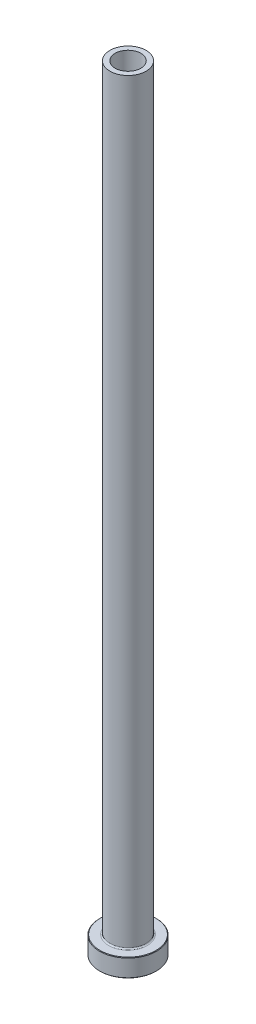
from build123d import *

# Parameters (mm, degrees)
FILLET1_R     = 0.5
CHAMFER1_SIZE = 0.2
CHAMFER3_SIZE = 0.5


with BuildPart() as part:
    # Sketch1 → Revolve1 (revolve)
    with BuildSketch(Plane.XY, mode=Mode.PRIVATE) as revolve1_sk:
        Polygon((-5, 300), (-7, 300), (-7, 7), (-11, 7), (-11, 0), (-5.25, 0), (-5.25, 243), (-5, 255), align=None)
    revolve(revolve1_sk.sketch.rotate(Axis((0, 92.187680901, 0), (0, -1, 0)), 270), axis=Axis((0, 92.187680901, 0), (0, -1, 0)))

    # Fillet1
    fillet1_edges = [part.edges().sort_by_distance(p)[0] for p in [
        (0, 7, -7),
    ]]
    fillet(fillet1_edges, radius=FILLET1_R)

    # Chamfer1
    chamfer1_edges = [part.edges().sort_by_distance(p)[0] for p in [
        (0, 0, -11),
        (0, 7, -11),
    ]]
    chamfer(chamfer1_edges, length=CHAMFER1_SIZE)

    # Chamfer3
    chamfer3_edges = [part.edges().sort_by_distance(p)[0] for p in [
        (0, 0, -5.25),
    ]]
    chamfer(chamfer3_edges, length=CHAMFER3_SIZE)


solid = part.part
